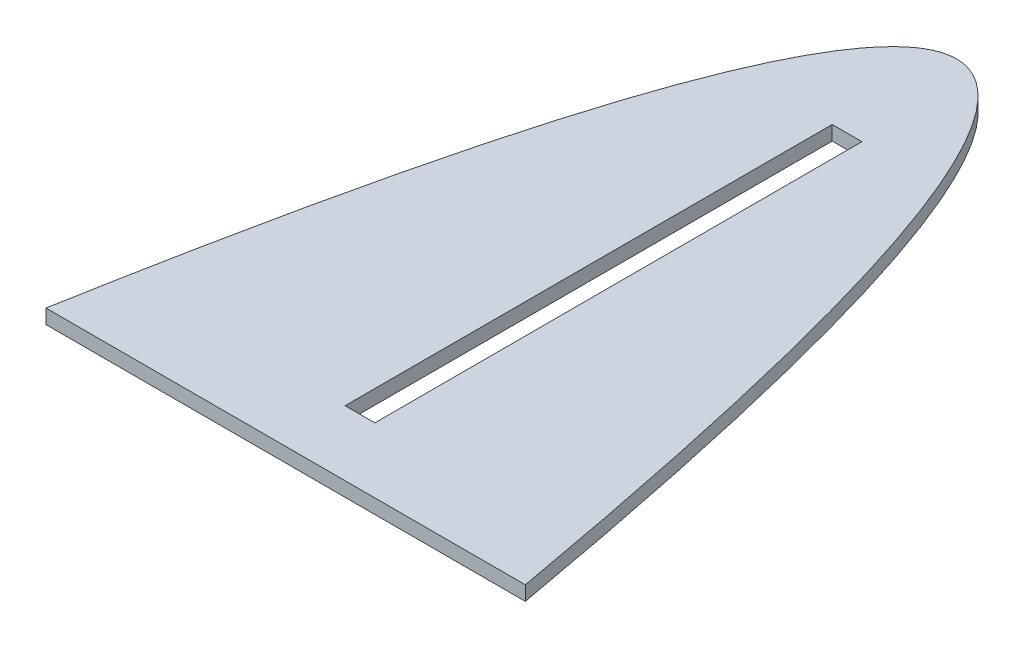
from build123d import *

# Parameters (mm, degrees)
BOSS_EXTRU_1_DEPTH      = 3
ENL_V_MAT_EXTRU_1_REACH = 174.073
ESQUISSE3_W             = 6.2
ESQUISSE3_H             = 101.61064262


with BuildPart() as part:
    # Esquisse2 → Boss.-Extru.1 (new body)
    with BuildSketch(Plane(origin=(0, 0, 0), x_dir=(1, 0, 0), z_dir=(0, 1, 0))):
        with BuildLine():
            Line((0, 0), (100, 0))
            add(Edge.make_bspline(
                [(0, 0), (50, 280), (100, 0)],
                knots=[0, 0, 0, 1, 1, 1], degree=2))
        make_face()
    extrude(amount=BOSS_EXTRU_1_DEPTH)

    # Esquisse3 → Enl_v. mat.-Extru.1 (cut, up to next)
    with BuildSketch(Plane(origin=(0, 3, 0), x_dir=(1, 0, 0), z_dir=(0, 1, 0)), mode=Mode.PRIVATE) as enl_v_mat_extru_1_sk1:
        with Locations((51.951483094, 64.365946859)):
            Rectangle(ESQUISSE3_W, ESQUISSE3_H)
    enl_v_mat_extru_1_tool1 = extrude(enl_v_mat_extru_1_sk1.sketch, amount=-ENL_V_MAT_EXTRU_1_REACH, mode=Mode.PRIVATE) & part.part
    add(enl_v_mat_extru_1_tool1.solids().sort_by_distance((51.951483, 3, -64.365947))[0], mode=Mode.SUBTRACT)


solid = part.part
